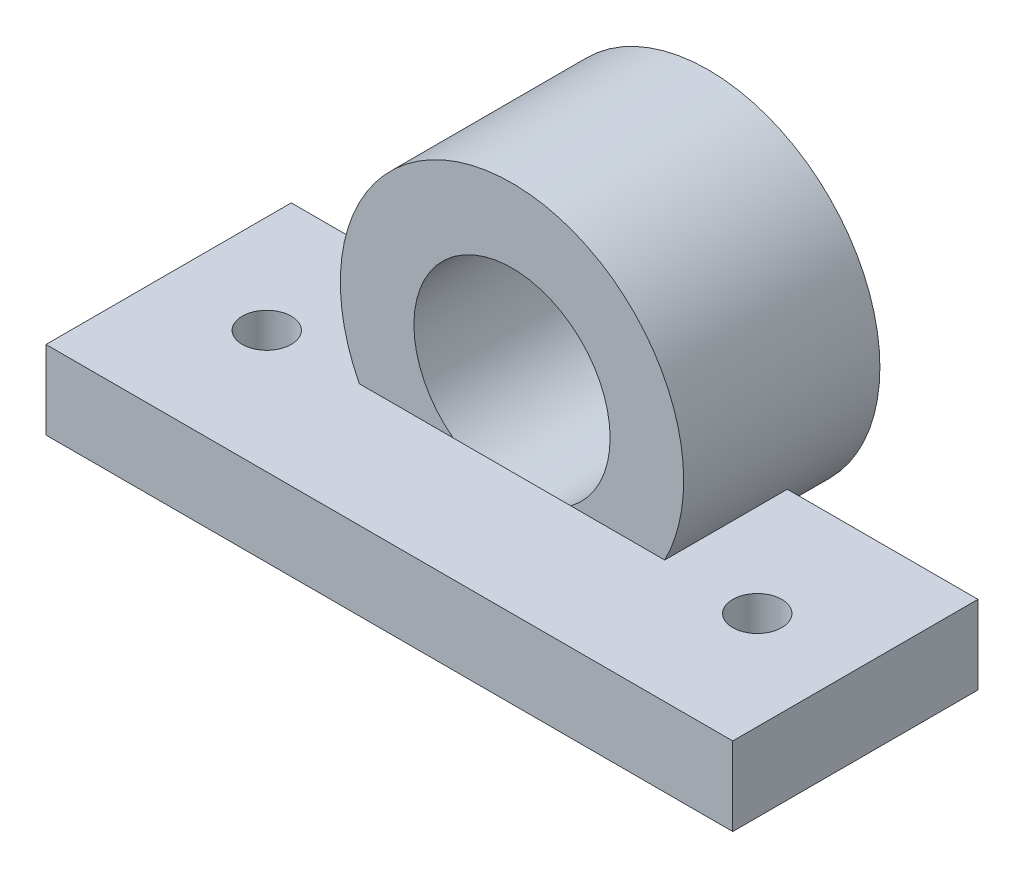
ISO-10303-21;
HEADER;
FILE_DESCRIPTION(('STEP AP214'),'2;1');
FILE_NAME('part.step','',(''),(''),'','','');
FILE_SCHEMA(('AUTOMOTIVE_DESIGN { 1 0 10303 214 1 1 1 1 }'));
ENDSEC;
DATA;
#1=APPLICATION_CONTEXT('core data for automotive mechanical design processes');
#2=APPLICATION_PROTOCOL_DEFINITION('international standard','automotive_design',2000,#1);
#3=PRODUCT_CONTEXT('',#1,'mechanical');
#4=PRODUCT('Part','Part','',(#3));
#5=PRODUCT_RELATED_PRODUCT_CATEGORY('part','',(#4));
#6=PRODUCT_DEFINITION_FORMATION('','',#4);
#7=PRODUCT_DEFINITION_CONTEXT('part definition',#1,'design');
#8=PRODUCT_DEFINITION('design','',#6,#7);
#9=PRODUCT_DEFINITION_SHAPE('','',#8);
#10=(LENGTH_UNIT() NAMED_UNIT(*) SI_UNIT(.MILLI.,.METRE.));
#11=(NAMED_UNIT(*) PLANE_ANGLE_UNIT() SI_UNIT($,.RADIAN.));
#12=(NAMED_UNIT(*) SI_UNIT($,.STERADIAN.) SOLID_ANGLE_UNIT());
#13=UNCERTAINTY_MEASURE_WITH_UNIT(LENGTH_MEASURE(1.E-05),#10,'distance_accuracy_value','');
#14=(GEOMETRIC_REPRESENTATION_CONTEXT(3) GLOBAL_UNCERTAINTY_ASSIGNED_CONTEXT((#13)) GLOBAL_UNIT_ASSIGNED_CONTEXT((#10,
#11,#12)) REPRESENTATION_CONTEXT('',''));
#15=CARTESIAN_POINT('',(0.,0.,0.));
#16=DIRECTION('',(0.,0.,1.));
#17=DIRECTION('',(1.,0.,0.));
#18=AXIS2_PLACEMENT_3D('',#15,#16,#17);
#19=CARTESIAN_POINT('',(-70.,-16.,-25.));
#20=DIRECTION('',(0.,0.,-1.));
#21=DIRECTION('',(-1.,0.,0.));
#22=AXIS2_PLACEMENT_3D('',#19,#20,#21);
#23=PLANE('',#22);
#24=CARTESIAN_POINT('',(0.,16.,-25.));
#25=DIRECTION('',(0.,0.,-1.));
#26=DIRECTION('',(-1.,0.,0.));
#27=AXIS2_PLACEMENT_3D('',#24,#25,#26);
#28=CIRCLE('',#27,35.);
#29=CARTESIAN_POINT('',(31.1287648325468,0.,-25.));
#30=VERTEX_POINT('',#29);
#31=CARTESIAN_POINT('',(14.1774468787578,-16.,-25.));
#32=VERTEX_POINT('',#31);
#33=EDGE_CURVE('E192',#30,#32,#28,.T.);
#34=ORIENTED_EDGE('',*,*,#33,.F.);
#35=DIRECTION('',(-1.,0.,0.));
#36=VECTOR('',#35,1.);
#37=CARTESIAN_POINT('',(-70.,0.,-25.));
#38=LINE('',#37,#36);
#39=CARTESIAN_POINT('',(70.,0.,-25.));
#40=VERTEX_POINT('',#39);
#41=EDGE_CURVE('E148',#40,#30,#38,.T.);
#42=ORIENTED_EDGE('',*,*,#41,.F.);
#43=DIRECTION('',(0.,1.,0.));
#44=VECTOR('',#43,1.);
#45=CARTESIAN_POINT('',(70.,-16.,-25.));
#46=LINE('',#45,#44);
#47=CARTESIAN_POINT('',(70.,-16.,-25.));
#48=VERTEX_POINT('',#47);
#49=EDGE_CURVE('E156',#48,#40,#46,.T.);
#50=ORIENTED_EDGE('',*,*,#49,.F.);
#51=DIRECTION('',(-1.,0.,0.));
#52=VECTOR('',#51,1.);
#53=CARTESIAN_POINT('',(-70.,-16.,-25.));
#54=LINE('',#53,#52);
#55=EDGE_CURVE('E165',#48,#32,#54,.T.);
#56=ORIENTED_EDGE('',*,*,#55,.T.);
#57=EDGE_LOOP('',(#34,#42,#50,#56));
#58=FACE_BOUND('',#57,.T.);
#59=ADVANCED_FACE('F41',(#58),#23,.T.);
#60=CARTESIAN_POINT('',(-70.,-16.,25.));
#61=DIRECTION('',(-1.,0.,0.));
#62=DIRECTION('',(0.,0.,1.));
#63=AXIS2_PLACEMENT_3D('',#60,#61,#62);
#64=PLANE('',#63);
#65=DIRECTION('',(0.,0.,1.));
#66=VECTOR('',#65,1.);
#67=CARTESIAN_POINT('',(-70.,0.,25.));
#68=LINE('',#67,#66);
#69=CARTESIAN_POINT('',(-70.,0.,-25.));
#70=VERTEX_POINT('',#69);
#71=CARTESIAN_POINT('',(-70.,0.,25.));
#72=VERTEX_POINT('',#71);
#73=EDGE_CURVE('E171',#70,#72,#68,.T.);
#74=ORIENTED_EDGE('',*,*,#73,.F.);
#75=DIRECTION('',(0.,1.,0.));
#76=VECTOR('',#75,1.);
#77=CARTESIAN_POINT('',(-70.,-16.,-25.));
#78=LINE('',#77,#76);
#79=CARTESIAN_POINT('',(-70.,-16.,-25.));
#80=VERTEX_POINT('',#79);
#81=EDGE_CURVE('E127',#80,#70,#78,.T.);
#82=ORIENTED_EDGE('',*,*,#81,.F.);
#83=DIRECTION('',(0.,0.,1.));
#84=VECTOR('',#83,1.);
#85=CARTESIAN_POINT('',(-70.,-16.,25.));
#86=LINE('',#85,#84);
#87=CARTESIAN_POINT('',(-70.,-16.,25.));
#88=VERTEX_POINT('',#87);
#89=EDGE_CURVE('E149',#80,#88,#86,.T.);
#90=ORIENTED_EDGE('',*,*,#89,.T.);
#91=DIRECTION('',(0.,1.,0.));
#92=VECTOR('',#91,1.);
#93=CARTESIAN_POINT('',(-70.,-16.,25.));
#94=LINE('',#93,#92);
#95=EDGE_CURVE('E134',#88,#72,#94,.T.);
#96=ORIENTED_EDGE('',*,*,#95,.T.);
#97=EDGE_LOOP('',(#74,#82,#90,#96));
#98=FACE_BOUND('',#97,.T.);
#99=ADVANCED_FACE('F43',(#98),#64,.T.);
#100=CARTESIAN_POINT('',(-14.1774468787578,-16.,-25.));
#101=VERTEX_POINT('',#100);
#102=CARTESIAN_POINT('',(-31.1287648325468,0.,-25.));
#103=VERTEX_POINT('',#102);
#104=EDGE_CURVE('E142',#101,#103,#28,.T.);
#105=ORIENTED_EDGE('',*,*,#104,.F.);
#106=EDGE_CURVE('E167',#101,#80,#54,.T.);
#107=ORIENTED_EDGE('',*,*,#106,.T.);
#108=ORIENTED_EDGE('',*,*,#81,.T.);
#109=EDGE_CURVE('E137',#103,#70,#38,.T.);
#110=ORIENTED_EDGE('',*,*,#109,.F.);
#111=EDGE_LOOP('',(#105,#107,#108,#110));
#112=FACE_BOUND('',#111,.T.);
#113=ADVANCED_FACE('F143',(#112),#23,.T.);
#114=CARTESIAN_POINT('',(70.,-16.,25.));
#115=DIRECTION('',(1.,0.,0.));
#116=DIRECTION('',(0.,0.,-1.));
#117=AXIS2_PLACEMENT_3D('',#114,#115,#116);
#118=PLANE('',#117);
#119=DIRECTION('',(0.,0.,-1.));
#120=VECTOR('',#119,1.);
#121=CARTESIAN_POINT('',(70.,0.,25.));
#122=LINE('',#121,#120);
#123=CARTESIAN_POINT('',(70.,0.,25.));
#124=VERTEX_POINT('',#123);
#125=EDGE_CURVE('E150',#124,#40,#122,.T.);
#126=ORIENTED_EDGE('',*,*,#125,.F.);
#127=DIRECTION('',(0.,1.,0.));
#128=VECTOR('',#127,1.);
#129=CARTESIAN_POINT('',(70.,-16.,25.));
#130=LINE('',#129,#128);
#131=CARTESIAN_POINT('',(70.,-16.,25.));
#132=VERTEX_POINT('',#131);
#133=EDGE_CURVE('E160',#132,#124,#130,.T.);
#134=ORIENTED_EDGE('',*,*,#133,.F.);
#135=DIRECTION('',(0.,0.,-1.));
#136=VECTOR('',#135,1.);
#137=CARTESIAN_POINT('',(70.,-16.,25.));
#138=LINE('',#137,#136);
#139=EDGE_CURVE('E173',#132,#48,#138,.T.);
#140=ORIENTED_EDGE('',*,*,#139,.T.);
#141=ORIENTED_EDGE('',*,*,#49,.T.);
#142=EDGE_LOOP('',(#126,#134,#140,#141));
#143=FACE_BOUND('',#142,.T.);
#144=ADVANCED_FACE('F250',(#143),#118,.T.);
#145=CARTESIAN_POINT('',(-70.,-16.,25.));
#146=DIRECTION('',(0.,0.,1.));
#147=DIRECTION('',(1.,0.,0.));
#148=AXIS2_PLACEMENT_3D('',#145,#146,#147);
#149=PLANE('',#148);
#150=DIRECTION('',(1.,0.,0.));
#151=VECTOR('',#150,1.);
#152=CARTESIAN_POINT('',(-70.,0.,25.));
#153=LINE('',#152,#151);
#154=EDGE_CURVE('E151',#72,#124,#153,.T.);
#155=ORIENTED_EDGE('',*,*,#154,.F.);
#156=ORIENTED_EDGE('',*,*,#95,.F.);
#157=DIRECTION('',(1.,0.,0.));
#158=VECTOR('',#157,1.);
#159=CARTESIAN_POINT('',(-70.,-16.,25.));
#160=LINE('',#159,#158);
#161=EDGE_CURVE('E182',#88,#132,#160,.T.);
#162=ORIENTED_EDGE('',*,*,#161,.T.);
#163=ORIENTED_EDGE('',*,*,#133,.T.);
#164=EDGE_LOOP('',(#155,#156,#162,#163));
#165=FACE_BOUND('',#164,.T.);
#166=ADVANCED_FACE('F176',(#165),#149,.T.);
#167=CARTESIAN_POINT('',(0.,-16.,0.));
#168=DIRECTION('',(0.,-1.,0.));
#169=DIRECTION('',(0.,0.,-1.));
#170=AXIS2_PLACEMENT_3D('',#167,#168,#169);
#171=PLANE('',#170);
#172=CARTESIAN_POINT('',(-50.,-16.,0.));
#173=DIRECTION('',(0.,1.,0.));
#174=DIRECTION('',(0.,0.,1.));
#175=AXIS2_PLACEMENT_3D('',#172,#173,#174);
#176=CIRCLE('',#175,5.);
#177=CARTESIAN_POINT('',(-50.,-16.,5.));
#178=VERTEX_POINT('',#177);
#179=EDGE_CURVE('E118',#178,#178,#176,.T.);
#180=ORIENTED_EDGE('',*,*,#179,.T.);
#181=EDGE_LOOP('',(#180));
#182=FACE_BOUND('',#181,.T.);
#183=CARTESIAN_POINT('',(50.,-16.,0.));
#184=DIRECTION('',(0.,1.,0.));
#185=DIRECTION('',(0.,0.,1.));
#186=AXIS2_PLACEMENT_3D('',#183,#184,#185);
#187=CIRCLE('',#186,5.);
#188=CARTESIAN_POINT('',(50.,-16.,5.));
#189=VERTEX_POINT('',#188);
#190=EDGE_CURVE('E204',#189,#189,#187,.T.);
#191=ORIENTED_EDGE('',*,*,#190,.T.);
#192=EDGE_LOOP('',(#191));
#193=FACE_BOUND('',#192,.T.);
#194=DIRECTION('',(0.,0.,1.));
#195=VECTOR('',#194,1.);
#196=CARTESIAN_POINT('',(14.1774468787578,-16.,-40.));
#197=LINE('',#196,#195);
#198=CARTESIAN_POINT('',(14.1774468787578,-16.,0.));
#199=VERTEX_POINT('',#198);
#200=EDGE_CURVE('E177',#32,#199,#197,.T.);
#201=ORIENTED_EDGE('',*,*,#200,.F.);
#202=ORIENTED_EDGE('',*,*,#55,.F.);
#203=ORIENTED_EDGE('',*,*,#139,.F.);
#204=ORIENTED_EDGE('',*,*,#161,.F.);
#205=ORIENTED_EDGE('',*,*,#89,.F.);
#206=ORIENTED_EDGE('',*,*,#106,.F.);
#207=DIRECTION('',(0.,0.,1.));
#208=VECTOR('',#207,1.);
#209=CARTESIAN_POINT('',(-14.1774468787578,-16.,-40.));
#210=LINE('',#209,#208);
#211=CARTESIAN_POINT('',(-14.1774468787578,-16.,0.));
#212=VERTEX_POINT('',#211);
#213=EDGE_CURVE('E194',#212,#101,#210,.F.);
#214=ORIENTED_EDGE('',*,*,#213,.F.);
#215=DIRECTION('',(-1.,0.,0.));
#216=VECTOR('',#215,1.);
#217=CARTESIAN_POINT('',(0.,-16.,0.));
#218=LINE('',#217,#216);
#219=EDGE_CURVE('E193',#199,#212,#218,.T.);
#220=ORIENTED_EDGE('',*,*,#219,.F.);
#221=EDGE_LOOP('',(#201,#202,#203,#204,#205,#206,#214,#220));
#222=FACE_BOUND('',#221,.T.);
#223=ADVANCED_FACE('F188',(#182,#193,#222),#171,.T.);
#224=CARTESIAN_POINT('',(0.,0.,0.));
#225=DIRECTION('',(0.,-1.,0.));
#226=DIRECTION('',(0.,0.,-1.));
#227=AXIS2_PLACEMENT_3D('',#224,#225,#226);
#228=PLANE('',#227);
#229=CARTESIAN_POINT('',(-50.,0.,0.));
#230=DIRECTION('',(0.,1.,0.));
#231=DIRECTION('',(0.,0.,1.));
#232=AXIS2_PLACEMENT_3D('',#229,#230,#231);
#233=CIRCLE('',#232,5.);
#234=CARTESIAN_POINT('',(-50.,0.,5.));
#235=VERTEX_POINT('',#234);
#236=EDGE_CURVE('E209',#235,#235,#233,.T.);
#237=ORIENTED_EDGE('',*,*,#236,.F.);
#238=EDGE_LOOP('',(#237));
#239=FACE_BOUND('',#238,.T.);
#240=CARTESIAN_POINT('',(50.,0.,0.));
#241=DIRECTION('',(0.,1.,0.));
#242=DIRECTION('',(0.,0.,1.));
#243=AXIS2_PLACEMENT_3D('',#240,#241,#242);
#244=CIRCLE('',#243,5.);
#245=CARTESIAN_POINT('',(50.,0.,5.));
#246=VERTEX_POINT('',#245);
#247=EDGE_CURVE('E210',#246,#246,#244,.T.);
#248=ORIENTED_EDGE('',*,*,#247,.F.);
#249=EDGE_LOOP('',(#248));
#250=FACE_BOUND('',#249,.T.);
#251=ORIENTED_EDGE('',*,*,#41,.T.);
#252=DIRECTION('',(0.,0.,1.));
#253=VECTOR('',#252,1.);
#254=CARTESIAN_POINT('',(31.1287648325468,0.,-40.));
#255=LINE('',#254,#253);
#256=CARTESIAN_POINT('',(31.1287648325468,0.,0.));
#257=VERTEX_POINT('',#256);
#258=EDGE_CURVE('E11',#30,#257,#255,.T.);
#259=ORIENTED_EDGE('',*,*,#258,.T.);
#260=DIRECTION('',(-1.,0.,0.));
#261=VECTOR('',#260,1.);
#262=CARTESIAN_POINT('',(0.,0.,0.));
#263=LINE('',#262,#261);
#264=CARTESIAN_POINT('',(12.,0.,0.));
#265=VERTEX_POINT('',#264);
#266=EDGE_CURVE('E126',#257,#265,#263,.T.);
#267=ORIENTED_EDGE('',*,*,#266,.T.);
#268=CARTESIAN_POINT('',(-12.,0.,0.));
#269=VERTEX_POINT('',#268);
#270=EDGE_CURVE('E116',#265,#269,#263,.T.);
#271=ORIENTED_EDGE('',*,*,#270,.T.);
#272=CARTESIAN_POINT('',(-31.1287648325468,0.,0.));
#273=VERTEX_POINT('',#272);
#274=EDGE_CURVE('E62',#269,#273,#263,.T.);
#275=ORIENTED_EDGE('',*,*,#274,.T.);
#276=DIRECTION('',(0.,0.,1.));
#277=VECTOR('',#276,1.);
#278=CARTESIAN_POINT('',(-31.1287648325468,0.,-40.));
#279=LINE('',#278,#277);
#280=EDGE_CURVE('E47',#273,#103,#279,.F.);
#281=ORIENTED_EDGE('',*,*,#280,.T.);
#282=ORIENTED_EDGE('',*,*,#109,.T.);
#283=ORIENTED_EDGE('',*,*,#73,.T.);
#284=ORIENTED_EDGE('',*,*,#154,.T.);
#285=ORIENTED_EDGE('',*,*,#125,.T.);
#286=EDGE_LOOP('',(#251,#259,#267,#271,#275,#281,#282,#283,#284,#285));
#287=FACE_BOUND('',#286,.T.);
#288=ADVANCED_FACE('F128',(#239,#250,#287),#228,.F.);
#289=CARTESIAN_POINT('',(0.,16.,0.));
#290=DIRECTION('',(0.,0.,1.));
#291=DIRECTION('',(1.,0.,0.));
#292=AXIS2_PLACEMENT_3D('',#289,#290,#291);
#293=PLANE('',#292);
#294=CARTESIAN_POINT('',(0.,16.,0.));
#295=DIRECTION('',(0.,0.,1.));
#296=DIRECTION('',(1.,0.,0.));
#297=AXIS2_PLACEMENT_3D('',#294,#295,#296);
#298=CIRCLE('',#297,20.);
#299=EDGE_CURVE('E115',#265,#269,#298,.T.);
#300=ORIENTED_EDGE('',*,*,#299,.F.);
#301=ORIENTED_EDGE('',*,*,#266,.F.);
#302=CARTESIAN_POINT('',(0.,16.,0.));
#303=DIRECTION('',(0.,0.,1.));
#304=DIRECTION('',(1.,0.,0.));
#305=AXIS2_PLACEMENT_3D('',#302,#303,#304);
#306=CIRCLE('',#305,35.);
#307=EDGE_CURVE('E121',#257,#273,#306,.T.);
#308=ORIENTED_EDGE('',*,*,#307,.T.);
#309=ORIENTED_EDGE('',*,*,#274,.F.);
#310=EDGE_LOOP('',(#300,#301,#308,#309));
#311=FACE_BOUND('',#310,.T.);
#312=ADVANCED_FACE('F124',(#311),#293,.T.);
#313=CARTESIAN_POINT('',(0.,16.,-40.));
#314=DIRECTION('',(0.,0.,1.));
#315=DIRECTION('',(1.,0.,0.));
#316=AXIS2_PLACEMENT_3D('',#313,#314,#315);
#317=CYLINDRICAL_SURFACE('',#316,35.);
#318=CARTESIAN_POINT('',(0.,16.,-40.));
#319=DIRECTION('',(0.,0.,1.));
#320=DIRECTION('',(1.,0.,0.));
#321=AXIS2_PLACEMENT_3D('',#318,#319,#320);
#322=CIRCLE('',#321,35.);
#323=CARTESIAN_POINT('',(35.,16.,-40.));
#324=VERTEX_POINT('',#323);
#325=EDGE_CURVE('E197',#324,#324,#322,.T.);
#326=ORIENTED_EDGE('',*,*,#325,.T.);
#327=EDGE_LOOP('',(#326));
#328=FACE_BOUND('',#327,.T.);
#329=ORIENTED_EDGE('',*,*,#33,.T.);
#330=ORIENTED_EDGE('',*,*,#200,.T.);
#331=EDGE_CURVE('E200',#212,#199,#306,.T.);
#332=ORIENTED_EDGE('',*,*,#331,.F.);
#333=ORIENTED_EDGE('',*,*,#213,.T.);
#334=ORIENTED_EDGE('',*,*,#104,.T.);
#335=ORIENTED_EDGE('',*,*,#280,.F.);
#336=ORIENTED_EDGE('',*,*,#307,.F.);
#337=ORIENTED_EDGE('',*,*,#258,.F.);
#338=EDGE_LOOP('',(#329,#330,#332,#333,#334,#335,#336,#337));
#339=FACE_BOUND('',#338,.T.);
#340=ADVANCED_FACE('F258',(#328,#339),#317,.T.);
#341=CARTESIAN_POINT('',(0.,16.,-40.));
#342=DIRECTION('',(0.,0.,1.));
#343=DIRECTION('',(1.,0.,0.));
#344=AXIS2_PLACEMENT_3D('',#341,#342,#343);
#345=PLANE('',#344);
#346=CARTESIAN_POINT('',(0.,16.,-40.));
#347=DIRECTION('',(0.,0.,1.));
#348=DIRECTION('',(1.,0.,0.));
#349=AXIS2_PLACEMENT_3D('',#346,#347,#348);
#350=CIRCLE('',#349,20.);
#351=CARTESIAN_POINT('',(20.,16.,-40.));
#352=VERTEX_POINT('',#351);
#353=EDGE_CURVE('E122',#352,#352,#350,.T.);
#354=ORIENTED_EDGE('',*,*,#353,.T.);
#355=EDGE_LOOP('',(#354));
#356=FACE_BOUND('',#355,.T.);
#357=ORIENTED_EDGE('',*,*,#325,.F.);
#358=EDGE_LOOP('',(#357));
#359=FACE_BOUND('',#358,.T.);
#360=ADVANCED_FACE('F262',(#356,#359),#345,.F.);
#361=ORIENTED_EDGE('',*,*,#331,.T.);
#362=ORIENTED_EDGE('',*,*,#219,.T.);
#363=EDGE_LOOP('',(#361,#362));
#364=FACE_BOUND('',#363,.T.);
#365=ADVANCED_FACE('F265',(#364),#293,.T.);
#366=CARTESIAN_POINT('',(0.,16.,0.));
#367=DIRECTION('',(0.,0.,1.));
#368=DIRECTION('',(1.,0.,0.));
#369=AXIS2_PLACEMENT_3D('',#366,#367,#368);
#370=PLANE('',#369);
#371=EDGE_CURVE('E54',#269,#265,#298,.T.);
#372=ORIENTED_EDGE('',*,*,#371,.F.);
#373=ORIENTED_EDGE('',*,*,#270,.F.);
#374=EDGE_LOOP('',(#372,#373));
#375=FACE_BOUND('',#374,.T.);
#376=ADVANCED_FACE('F120',(#375),#370,.F.);
#377=CARTESIAN_POINT('',(0.,16.,-40.));
#378=DIRECTION('',(0.,0.,1.));
#379=DIRECTION('',(1.,0.,0.));
#380=AXIS2_PLACEMENT_3D('',#377,#378,#379);
#381=CYLINDRICAL_SURFACE('',#380,20.);
#382=ORIENTED_EDGE('',*,*,#353,.F.);
#383=EDGE_LOOP('',(#382));
#384=FACE_BOUND('',#383,.T.);
#385=ORIENTED_EDGE('',*,*,#371,.T.);
#386=ORIENTED_EDGE('',*,*,#299,.T.);
#387=EDGE_LOOP('',(#385,#386));
#388=FACE_BOUND('',#387,.T.);
#389=ADVANCED_FACE('F114',(#384,#388),#381,.F.);
#390=CARTESIAN_POINT('',(50.,-16.,0.));
#391=DIRECTION('',(0.,1.,0.));
#392=DIRECTION('',(0.,0.,1.));
#393=AXIS2_PLACEMENT_3D('',#390,#391,#392);
#394=CYLINDRICAL_SURFACE('',#393,5.);
#395=ORIENTED_EDGE('',*,*,#190,.F.);
#396=EDGE_LOOP('',(#395));
#397=FACE_BOUND('',#396,.T.);
#398=ORIENTED_EDGE('',*,*,#247,.T.);
#399=EDGE_LOOP('',(#398));
#400=FACE_BOUND('',#399,.T.);
#401=ADVANCED_FACE('F222',(#397,#400),#394,.F.);
#402=CARTESIAN_POINT('',(-50.,-16.,0.));
#403=DIRECTION('',(0.,1.,0.));
#404=DIRECTION('',(0.,0.,1.));
#405=AXIS2_PLACEMENT_3D('',#402,#403,#404);
#406=CYLINDRICAL_SURFACE('',#405,5.);
#407=ORIENTED_EDGE('',*,*,#179,.F.);
#408=EDGE_LOOP('',(#407));
#409=FACE_BOUND('',#408,.T.);
#410=ORIENTED_EDGE('',*,*,#236,.T.);
#411=EDGE_LOOP('',(#410));
#412=FACE_BOUND('',#411,.T.);
#413=ADVANCED_FACE('F217',(#409,#412),#406,.F.);
#414=CLOSED_SHELL('',(#59,#99,#113,#144,#166,#223,#288,#312,#340,#360,#365,#376,#389,#401,#413));
#415=MANIFOLD_SOLID_BREP('B2',#414);
#416=ADVANCED_BREP_SHAPE_REPRESENTATION('',(#18,#415),#14);
#417=SHAPE_DEFINITION_REPRESENTATION(#9,#416);
ENDSEC;
END-ISO-10303-21;
